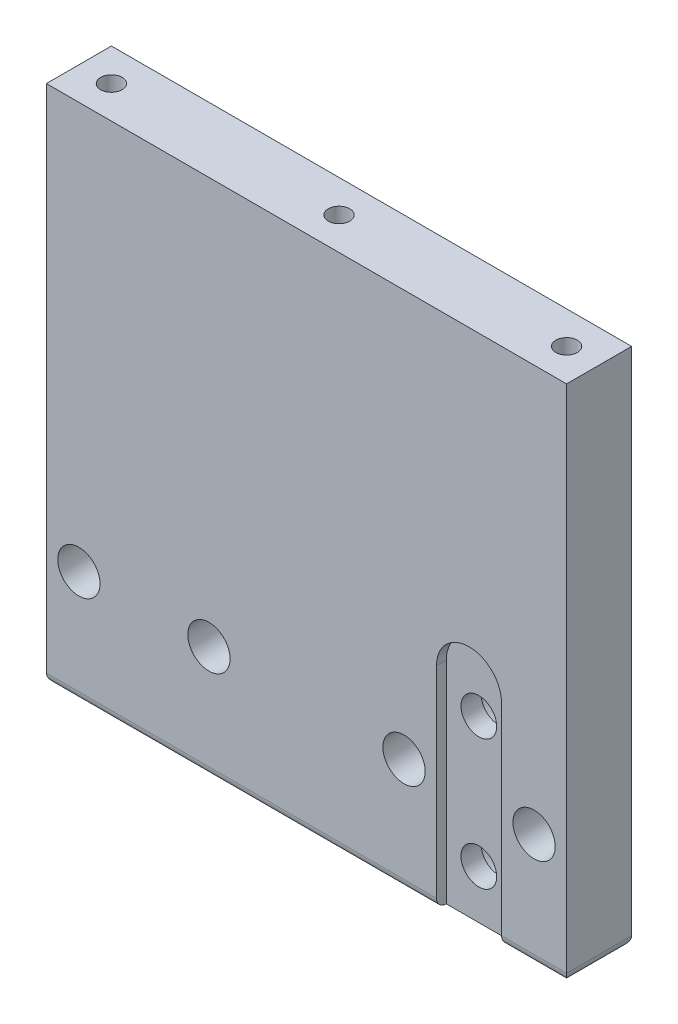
ISO-10303-21;
HEADER;
FILE_DESCRIPTION(('STEP AP214'),'2;1');
FILE_NAME('part.step','',(''),(''),'','','');
FILE_SCHEMA(('AUTOMOTIVE_DESIGN { 1 0 10303 214 1 1 1 1 }'));
ENDSEC;
DATA;
#1=APPLICATION_CONTEXT('core data for automotive mechanical design processes');
#2=APPLICATION_PROTOCOL_DEFINITION('international standard','automotive_design',2000,#1);
#3=PRODUCT_CONTEXT('',#1,'mechanical');
#4=PRODUCT('Part','Part','',(#3));
#5=PRODUCT_RELATED_PRODUCT_CATEGORY('part','',(#4));
#6=PRODUCT_DEFINITION_FORMATION('','',#4);
#7=PRODUCT_DEFINITION_CONTEXT('part definition',#1,'design');
#8=PRODUCT_DEFINITION('design','',#6,#7);
#9=PRODUCT_DEFINITION_SHAPE('','',#8);
#10=(LENGTH_UNIT() NAMED_UNIT(*) SI_UNIT(.MILLI.,.METRE.));
#11=(NAMED_UNIT(*) PLANE_ANGLE_UNIT() SI_UNIT($,.RADIAN.));
#12=(NAMED_UNIT(*) SI_UNIT($,.STERADIAN.) SOLID_ANGLE_UNIT());
#13=UNCERTAINTY_MEASURE_WITH_UNIT(LENGTH_MEASURE(1.E-05),#10,'distance_accuracy_value','');
#14=(GEOMETRIC_REPRESENTATION_CONTEXT(3) GLOBAL_UNCERTAINTY_ASSIGNED_CONTEXT((#13)) GLOBAL_UNIT_ASSIGNED_CONTEXT((#10,
#11,#12)) REPRESENTATION_CONTEXT('',''));
#15=CARTESIAN_POINT('',(0.,0.,0.));
#16=DIRECTION('',(0.,0.,1.));
#17=DIRECTION('',(1.,0.,0.));
#18=AXIS2_PLACEMENT_3D('',#15,#16,#17);
#19=CARTESIAN_POINT('',(25.,-10.,0.));
#20=DIRECTION('',(0.,0.,-1.));
#21=DIRECTION('',(-1.,0.,0.));
#22=AXIS2_PLACEMENT_3D('',#19,#20,#21);
#23=CYLINDRICAL_SURFACE('',#22,2.75);
#24=CARTESIAN_POINT('',(25.,-10.,8.5));
#25=DIRECTION('',(0.,0.,-1.));
#26=DIRECTION('',(-1.,0.,0.));
#27=AXIS2_PLACEMENT_3D('',#24,#25,#26);
#28=CIRCLE('',#27,2.75);
#29=CARTESIAN_POINT('',(22.25,-10.,8.5));
#30=VERTEX_POINT('',#29);
#31=EDGE_CURVE('E19',#30,#30,#28,.T.);
#32=ORIENTED_EDGE('',*,*,#31,.F.);
#33=EDGE_LOOP('',(#32));
#34=FACE_BOUND('',#33,.T.);
#35=CARTESIAN_POINT('',(25.,-10.,5.4));
#36=DIRECTION('',(0.,0.,-1.));
#37=DIRECTION('',(-1.,0.,0.));
#38=AXIS2_PLACEMENT_3D('',#35,#36,#37);
#39=CIRCLE('',#38,2.75);
#40=CARTESIAN_POINT('',(22.25,-10.,5.4));
#41=VERTEX_POINT('',#40);
#42=EDGE_CURVE('E140',#41,#41,#39,.T.);
#43=ORIENTED_EDGE('',*,*,#42,.T.);
#44=EDGE_LOOP('',(#43));
#45=FACE_BOUND('',#44,.T.);
#46=ADVANCED_FACE('F16',(#34,#45),#23,.F.);
#47=CARTESIAN_POINT('',(25.,10.,0.));
#48=DIRECTION('',(0.,0.,-1.));
#49=DIRECTION('',(-1.,0.,0.));
#50=AXIS2_PLACEMENT_3D('',#47,#48,#49);
#51=CYLINDRICAL_SURFACE('',#50,2.75);
#52=CARTESIAN_POINT('',(25.,10.,8.5));
#53=DIRECTION('',(0.,0.,-1.));
#54=DIRECTION('',(-1.,0.,0.));
#55=AXIS2_PLACEMENT_3D('',#52,#53,#54);
#56=CIRCLE('',#55,2.75);
#57=CARTESIAN_POINT('',(22.25,10.,8.5));
#58=VERTEX_POINT('',#57);
#59=EDGE_CURVE('E148',#58,#58,#56,.T.);
#60=ORIENTED_EDGE('',*,*,#59,.F.);
#61=EDGE_LOOP('',(#60));
#62=FACE_BOUND('',#61,.T.);
#63=CARTESIAN_POINT('',(25.,10.,5.4));
#64=DIRECTION('',(0.,0.,-1.));
#65=DIRECTION('',(-1.,0.,0.));
#66=AXIS2_PLACEMENT_3D('',#63,#64,#65);
#67=CIRCLE('',#66,2.75);
#68=CARTESIAN_POINT('',(22.25,10.,5.4));
#69=VERTEX_POINT('',#68);
#70=EDGE_CURVE('E165',#69,#69,#67,.T.);
#71=ORIENTED_EDGE('',*,*,#70,.T.);
#72=EDGE_LOOP('',(#71));
#73=FACE_BOUND('',#72,.T.);
#74=ADVANCED_FACE('F238',(#62,#73),#51,.F.);
#75=CARTESIAN_POINT('',(-35.,50.9999999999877,5.00000000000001));
#76=DIRECTION('',(0.,1.,0.));
#77=DIRECTION('',(0.,0.,1.));
#78=AXIS2_PLACEMENT_3D('',#75,#76,#77);
#79=CONICAL_SURFACE('',#78,1.64999999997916,1.04719755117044);
#80=CARTESIAN_POINT('',(-35.,50.0473720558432,5.0000000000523));
#81=VERTEX_POINT('',#80);
#82=VERTEX_LOOP('',#81);
#83=FACE_BOUND('',#82,.T.);
#84=CARTESIAN_POINT('',(-35.,51.,5.00000000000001));
#85=DIRECTION('',(0.,1.,0.));
#86=DIRECTION('',(0.,0.,1.));
#87=AXIS2_PLACEMENT_3D('',#84,#85,#86);
#88=CIRCLE('',#87,1.65);
#89=CARTESIAN_POINT('',(-35.,51.,6.65));
#90=VERTEX_POINT('',#89);
#91=EDGE_CURVE('E162',#90,#90,#88,.T.);
#92=ORIENTED_EDGE('',*,*,#91,.T.);
#93=EDGE_LOOP('',(#92));
#94=FACE_BOUND('',#93,.T.);
#95=ADVANCED_FACE('F338',(#83,#94),#79,.F.);
#96=CARTESIAN_POINT('',(35.,50.9999999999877,5.));
#97=DIRECTION('',(0.,1.,0.));
#98=DIRECTION('',(0.,0.,1.));
#99=AXIS2_PLACEMENT_3D('',#96,#97,#98);
#100=CONICAL_SURFACE('',#99,1.64999999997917,1.04719755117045);
#101=CARTESIAN_POINT('',(35.,50.0473720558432,5.0000000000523));
#102=VERTEX_POINT('',#101);
#103=VERTEX_LOOP('',#102);
#104=FACE_BOUND('',#103,.T.);
#105=CARTESIAN_POINT('',(35.,51.,5.));
#106=DIRECTION('',(0.,1.,0.));
#107=DIRECTION('',(0.,0.,1.));
#108=AXIS2_PLACEMENT_3D('',#105,#106,#107);
#109=CIRCLE('',#108,1.65);
#110=CARTESIAN_POINT('',(35.,51.,6.65));
#111=VERTEX_POINT('',#110);
#112=EDGE_CURVE('E159',#111,#111,#109,.T.);
#113=ORIENTED_EDGE('',*,*,#112,.T.);
#114=EDGE_LOOP('',(#113));
#115=FACE_BOUND('',#114,.T.);
#116=ADVANCED_FACE('F340',(#104,#115),#100,.F.);
#117=CARTESIAN_POINT('',(0.,50.9999999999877,5.));
#118=DIRECTION('',(0.,1.,0.));
#119=DIRECTION('',(0.,0.,1.));
#120=AXIS2_PLACEMENT_3D('',#117,#118,#119);
#121=CONICAL_SURFACE('',#120,1.65000000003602,1.04719755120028);
#122=CARTESIAN_POINT('',(0.,50.0473720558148,5.));
#123=VERTEX_POINT('',#122);
#124=VERTEX_LOOP('',#123);
#125=FACE_BOUND('',#124,.T.);
#126=CARTESIAN_POINT('',(0.,51.,5.));
#127=DIRECTION('',(0.,1.,0.));
#128=DIRECTION('',(0.,0.,1.));
#129=AXIS2_PLACEMENT_3D('',#126,#127,#128);
#130=CIRCLE('',#129,1.65);
#131=CARTESIAN_POINT('',(0.,51.,6.65));
#132=VERTEX_POINT('',#131);
#133=EDGE_CURVE('E156',#132,#132,#130,.T.);
#134=ORIENTED_EDGE('',*,*,#133,.T.);
#135=EDGE_LOOP('',(#134));
#136=FACE_BOUND('',#135,.T.);
#137=ADVANCED_FACE('F347',(#125,#136),#121,.F.);
#138=CARTESIAN_POINT('',(25.,15.,8.5));
#139=DIRECTION('',(0.,0.,1.));
#140=DIRECTION('',(1.,0.,0.));
#141=AXIS2_PLACEMENT_3D('',#138,#139,#140);
#142=PLANE('',#141);
#143=DIRECTION('',(0.,1.,0.));
#144=VECTOR('',#143,1.);
#145=CARTESIAN_POINT('',(30.,-17.5,8.5));
#146=LINE('',#145,#144);
#147=CARTESIAN_POINT('',(30.,-17.5,8.5));
#148=VERTEX_POINT('',#147);
#149=CARTESIAN_POINT('',(30.,15.,8.5));
#150=VERTEX_POINT('',#149);
#151=EDGE_CURVE('E103',#148,#150,#146,.T.);
#152=ORIENTED_EDGE('',*,*,#151,.T.);
#153=CARTESIAN_POINT('',(25.,15.,8.5));
#154=DIRECTION('',(0.,0.,1.));
#155=DIRECTION('',(1.,0.,0.));
#156=AXIS2_PLACEMENT_3D('',#153,#154,#155);
#157=CIRCLE('',#156,5.);
#158=CARTESIAN_POINT('',(20.,15.,8.5));
#159=VERTEX_POINT('',#158);
#160=EDGE_CURVE('E141',#150,#159,#157,.T.);
#161=ORIENTED_EDGE('',*,*,#160,.T.);
#162=DIRECTION('',(0.,1.,0.));
#163=VECTOR('',#162,1.);
#164=CARTESIAN_POINT('',(20.,-17.5,8.5));
#165=LINE('',#164,#163);
#166=CARTESIAN_POINT('',(20.,-17.5,8.5));
#167=VERTEX_POINT('',#166);
#168=EDGE_CURVE('E107',#159,#167,#165,.F.);
#169=ORIENTED_EDGE('',*,*,#168,.T.);
#170=DIRECTION('',(-1.,0.,0.));
#171=VECTOR('',#170,1.);
#172=CARTESIAN_POINT('',(-40.,-17.5,8.5));
#173=LINE('',#172,#171);
#174=EDGE_CURVE('E151',#167,#148,#173,.F.);
#175=ORIENTED_EDGE('',*,*,#174,.T.);
#176=EDGE_LOOP('',(#152,#161,#169,#175));
#177=FACE_BOUND('',#176,.T.);
#178=ORIENTED_EDGE('',*,*,#59,.T.);
#179=EDGE_LOOP('',(#178));
#180=FACE_BOUND('',#179,.T.);
#181=ORIENTED_EDGE('',*,*,#31,.T.);
#182=EDGE_LOOP('',(#181));
#183=FACE_BOUND('',#182,.T.);
#184=ADVANCED_FACE('F234',(#177,#180,#183),#142,.T.);
#185=CARTESIAN_POINT('',(30.,-17.5,8.5));
#186=DIRECTION('',(1.,0.,0.));
#187=DIRECTION('',(0.,0.,-1.));
#188=AXIS2_PLACEMENT_3D('',#185,#186,#187);
#189=PLANE('',#188);
#190=CARTESIAN_POINT('',(30.,-16.,8.5));
#191=DIRECTION('',(-1.,0.,0.));
#192=DIRECTION('',(0.,-1.,0.));
#193=AXIS2_PLACEMENT_3D('',#190,#191,#192);
#194=CIRCLE('',#193,1.5);
#195=CARTESIAN_POINT('',(30.,-16.,10.));
#196=VERTEX_POINT('',#195);
#197=EDGE_CURVE('E101',#196,#148,#194,.F.);
#198=ORIENTED_EDGE('',*,*,#197,.F.);
#199=DIRECTION('',(0.,1.,0.));
#200=VECTOR('',#199,1.);
#201=CARTESIAN_POINT('',(30.,-17.5,10.));
#202=LINE('',#201,#200);
#203=CARTESIAN_POINT('',(30.,15.,10.));
#204=VERTEX_POINT('',#203);
#205=EDGE_CURVE('E86',#204,#196,#202,.F.);
#206=ORIENTED_EDGE('',*,*,#205,.F.);
#207=DIRECTION('',(0.,0.,1.));
#208=VECTOR('',#207,1.);
#209=CARTESIAN_POINT('',(30.,15.,8.5));
#210=LINE('',#209,#208);
#211=EDGE_CURVE('E142',#204,#150,#210,.F.);
#212=ORIENTED_EDGE('',*,*,#211,.T.);
#213=ORIENTED_EDGE('',*,*,#151,.F.);
#214=EDGE_LOOP('',(#198,#206,#212,#213));
#215=FACE_BOUND('',#214,.T.);
#216=ADVANCED_FACE('F102',(#215),#189,.F.);
#217=CARTESIAN_POINT('',(-40.,-16.,8.5));
#218=DIRECTION('',(-1.,0.,0.));
#219=DIRECTION('',(0.,-1.,0.));
#220=AXIS2_PLACEMENT_3D('',#217,#218,#219);
#221=CYLINDRICAL_SURFACE('',#220,1.5);
#222=CARTESIAN_POINT('',(38.5,-16.,8.5));
#223=DIRECTION('',(0.707106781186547,0.,-0.707106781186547));
#224=DIRECTION('',(-0.707106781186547,0.,-0.707106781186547));
#225=AXIS2_PLACEMENT_3D('',#222,#223,#224);
#226=ELLIPSE('',#225,2.12132034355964,1.5);
#227=CARTESIAN_POINT('',(40.,-16.,10.));
#228=VERTEX_POINT('',#227);
#229=CARTESIAN_POINT('',(38.5,-17.5,8.5));
#230=VERTEX_POINT('',#229);
#231=EDGE_CURVE('E110',#228,#230,#226,.T.);
#232=ORIENTED_EDGE('',*,*,#231,.F.);
#233=DIRECTION('',(1.,0.,0.));
#234=VECTOR('',#233,1.);
#235=CARTESIAN_POINT('',(-40.,-16.,10.));
#236=LINE('',#235,#234);
#237=EDGE_CURVE('E91',#196,#228,#236,.T.);
#238=ORIENTED_EDGE('',*,*,#237,.F.);
#239=ORIENTED_EDGE('',*,*,#197,.T.);
#240=DIRECTION('',(-1.,0.,0.));
#241=VECTOR('',#240,1.);
#242=CARTESIAN_POINT('',(-40.,-17.5,8.5));
#243=LINE('',#242,#241);
#244=EDGE_CURVE('E149',#148,#230,#243,.F.);
#245=ORIENTED_EDGE('',*,*,#244,.T.);
#246=EDGE_LOOP('',(#232,#238,#239,#245));
#247=FACE_BOUND('',#246,.T.);
#248=ADVANCED_FACE('F109',(#247),#221,.T.);
#249=CARTESIAN_POINT('',(-40.,-16.,8.5));
#250=DIRECTION('',(-1.,0.,0.));
#251=DIRECTION('',(0.,-1.,0.));
#252=AXIS2_PLACEMENT_3D('',#249,#250,#251);
#253=CYLINDRICAL_SURFACE('',#252,1.5);
#254=CARTESIAN_POINT('',(-38.5,-16.,8.5));
#255=DIRECTION('',(-0.707106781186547,0.,-0.707106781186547));
#256=DIRECTION('',(0.707106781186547,0.,-0.707106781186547));
#257=AXIS2_PLACEMENT_3D('',#254,#255,#256);
#258=ELLIPSE('',#257,2.12132034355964,1.5);
#259=CARTESIAN_POINT('',(-38.5,-17.5,8.5));
#260=VERTEX_POINT('',#259);
#261=CARTESIAN_POINT('',(-40.,-16.,10.));
#262=VERTEX_POINT('',#261);
#263=EDGE_CURVE('E130',#260,#262,#258,.T.);
#264=ORIENTED_EDGE('',*,*,#263,.F.);
#265=DIRECTION('',(-1.,0.,0.));
#266=VECTOR('',#265,1.);
#267=CARTESIAN_POINT('',(-40.,-17.5,8.5));
#268=LINE('',#267,#266);
#269=EDGE_CURVE('E129',#260,#167,#268,.F.);
#270=ORIENTED_EDGE('',*,*,#269,.T.);
#271=CARTESIAN_POINT('',(20.,-16.,8.5));
#272=DIRECTION('',(-1.,0.,0.));
#273=DIRECTION('',(0.,-1.,0.));
#274=AXIS2_PLACEMENT_3D('',#271,#272,#273);
#275=CIRCLE('',#274,1.5);
#276=CARTESIAN_POINT('',(20.,-16.,10.));
#277=VERTEX_POINT('',#276);
#278=EDGE_CURVE('E144',#167,#277,#275,.T.);
#279=ORIENTED_EDGE('',*,*,#278,.T.);
#280=DIRECTION('',(1.,0.,0.));
#281=VECTOR('',#280,1.);
#282=CARTESIAN_POINT('',(-40.,-16.,10.));
#283=LINE('',#282,#281);
#284=EDGE_CURVE('E111',#262,#277,#283,.T.);
#285=ORIENTED_EDGE('',*,*,#284,.F.);
#286=EDGE_LOOP('',(#264,#270,#279,#285));
#287=FACE_BOUND('',#286,.T.);
#288=ADVANCED_FACE('F363',(#287),#253,.T.);
#289=CARTESIAN_POINT('',(20.,-17.5,8.5));
#290=DIRECTION('',(-1.,0.,0.));
#291=DIRECTION('',(0.,0.,1.));
#292=AXIS2_PLACEMENT_3D('',#289,#290,#291);
#293=PLANE('',#292);
#294=ORIENTED_EDGE('',*,*,#278,.F.);
#295=ORIENTED_EDGE('',*,*,#168,.F.);
#296=DIRECTION('',(0.,0.,1.));
#297=VECTOR('',#296,1.);
#298=CARTESIAN_POINT('',(20.,15.,8.5));
#299=LINE('',#298,#297);
#300=CARTESIAN_POINT('',(20.,15.,10.));
#301=VERTEX_POINT('',#300);
#302=EDGE_CURVE('E137',#159,#301,#299,.T.);
#303=ORIENTED_EDGE('',*,*,#302,.T.);
#304=DIRECTION('',(0.,1.,0.));
#305=VECTOR('',#304,1.);
#306=CARTESIAN_POINT('',(20.,-17.5,10.));
#307=LINE('',#306,#305);
#308=EDGE_CURVE('E113',#277,#301,#307,.T.);
#309=ORIENTED_EDGE('',*,*,#308,.F.);
#310=EDGE_LOOP('',(#294,#295,#303,#309));
#311=FACE_BOUND('',#310,.T.);
#312=ADVANCED_FACE('F255',(#311),#293,.F.);
#313=CARTESIAN_POINT('',(25.,15.,8.5));
#314=DIRECTION('',(0.,0.,1.));
#315=DIRECTION('',(1.,0.,0.));
#316=AXIS2_PLACEMENT_3D('',#313,#314,#315);
#317=CYLINDRICAL_SURFACE('',#316,5.);
#318=ORIENTED_EDGE('',*,*,#302,.F.);
#319=ORIENTED_EDGE('',*,*,#160,.F.);
#320=ORIENTED_EDGE('',*,*,#211,.F.);
#321=CARTESIAN_POINT('',(25.,15.,10.));
#322=DIRECTION('',(0.,0.,1.));
#323=DIRECTION('',(1.,0.,0.));
#324=AXIS2_PLACEMENT_3D('',#321,#322,#323);
#325=CIRCLE('',#324,5.);
#326=EDGE_CURVE('E94',#301,#204,#325,.F.);
#327=ORIENTED_EDGE('',*,*,#326,.F.);
#328=EDGE_LOOP('',(#318,#319,#320,#327));
#329=FACE_BOUND('',#328,.T.);
#330=ADVANCED_FACE('F244',(#329),#317,.F.);
#331=CARTESIAN_POINT('',(27.75,-10.,5.4));
#332=DIRECTION('',(0.,0.,1.));
#333=DIRECTION('',(1.,0.,0.));
#334=AXIS2_PLACEMENT_3D('',#331,#332,#333);
#335=PLANE('',#334);
#336=CARTESIAN_POINT('',(25.,-10.,5.4));
#337=DIRECTION('',(0.,0.,-1.));
#338=DIRECTION('',(-1.,0.,0.));
#339=AXIS2_PLACEMENT_3D('',#336,#337,#338);
#340=CIRCLE('',#339,5.);
#341=CARTESIAN_POINT('',(20.,-10.,5.4));
#342=VERTEX_POINT('',#341);
#343=EDGE_CURVE('E215',#342,#342,#340,.T.);
#344=ORIENTED_EDGE('',*,*,#343,.T.);
#345=EDGE_LOOP('',(#344));
#346=FACE_BOUND('',#345,.T.);
#347=ORIENTED_EDGE('',*,*,#42,.F.);
#348=EDGE_LOOP('',(#347));
#349=FACE_BOUND('',#348,.T.);
#350=ADVANCED_FACE('F241',(#346,#349),#335,.F.);
#351=CARTESIAN_POINT('',(27.75,10.,5.4));
#352=DIRECTION('',(0.,0.,1.));
#353=DIRECTION('',(1.,0.,0.));
#354=AXIS2_PLACEMENT_3D('',#351,#352,#353);
#355=PLANE('',#354);
#356=CARTESIAN_POINT('',(25.,10.,5.4));
#357=DIRECTION('',(0.,0.,-1.));
#358=DIRECTION('',(-1.,0.,0.));
#359=AXIS2_PLACEMENT_3D('',#356,#357,#358);
#360=CIRCLE('',#359,5.);
#361=CARTESIAN_POINT('',(20.,10.,5.4));
#362=VERTEX_POINT('',#361);
#363=EDGE_CURVE('E212',#362,#362,#360,.T.);
#364=ORIENTED_EDGE('',*,*,#363,.T.);
#365=EDGE_LOOP('',(#364));
#366=FACE_BOUND('',#365,.T.);
#367=ORIENTED_EDGE('',*,*,#70,.F.);
#368=EDGE_LOOP('',(#367));
#369=FACE_BOUND('',#368,.T.);
#370=ADVANCED_FACE('F243',(#366,#369),#355,.F.);
#371=CARTESIAN_POINT('',(-35.,62.5,5.00000000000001));
#372=DIRECTION('',(0.,1.,0.));
#373=DIRECTION('',(0.,0.,1.));
#374=AXIS2_PLACEMENT_3D('',#371,#372,#373);
#375=CYLINDRICAL_SURFACE('',#374,1.65);
#376=ORIENTED_EDGE('',*,*,#91,.F.);
#377=EDGE_LOOP('',(#376));
#378=FACE_BOUND('',#377,.T.);
#379=CARTESIAN_POINT('',(-35.,62.5,5.00000000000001));
#380=DIRECTION('',(0.,1.,0.));
#381=DIRECTION('',(0.,0.,1.));
#382=AXIS2_PLACEMENT_3D('',#379,#380,#381);
#383=CIRCLE('',#382,1.65);
#384=CARTESIAN_POINT('',(-35.,62.5,6.65));
#385=VERTEX_POINT('',#384);
#386=EDGE_CURVE('E197',#385,#385,#383,.T.);
#387=ORIENTED_EDGE('',*,*,#386,.T.);
#388=EDGE_LOOP('',(#387));
#389=FACE_BOUND('',#388,.T.);
#390=ADVANCED_FACE('F252',(#378,#389),#375,.F.);
#391=CARTESIAN_POINT('',(35.,62.5,5.));
#392=DIRECTION('',(0.,1.,0.));
#393=DIRECTION('',(0.,0.,1.));
#394=AXIS2_PLACEMENT_3D('',#391,#392,#393);
#395=CYLINDRICAL_SURFACE('',#394,1.65);
#396=ORIENTED_EDGE('',*,*,#112,.F.);
#397=EDGE_LOOP('',(#396));
#398=FACE_BOUND('',#397,.T.);
#399=CARTESIAN_POINT('',(35.,62.5,5.));
#400=DIRECTION('',(0.,1.,0.));
#401=DIRECTION('',(0.,0.,1.));
#402=AXIS2_PLACEMENT_3D('',#399,#400,#401);
#403=CIRCLE('',#402,1.65);
#404=CARTESIAN_POINT('',(35.,62.5,6.65));
#405=VERTEX_POINT('',#404);
#406=EDGE_CURVE('E194',#405,#405,#403,.T.);
#407=ORIENTED_EDGE('',*,*,#406,.T.);
#408=EDGE_LOOP('',(#407));
#409=FACE_BOUND('',#408,.T.);
#410=ADVANCED_FACE('F324',(#398,#409),#395,.F.);
#411=CARTESIAN_POINT('',(0.,62.5,5.));
#412=DIRECTION('',(0.,1.,0.));
#413=DIRECTION('',(0.,0.,1.));
#414=AXIS2_PLACEMENT_3D('',#411,#412,#413);
#415=CYLINDRICAL_SURFACE('',#414,1.65);
#416=ORIENTED_EDGE('',*,*,#133,.F.);
#417=EDGE_LOOP('',(#416));
#418=FACE_BOUND('',#417,.T.);
#419=CARTESIAN_POINT('',(0.,62.5,5.));
#420=DIRECTION('',(0.,1.,0.));
#421=DIRECTION('',(0.,0.,1.));
#422=AXIS2_PLACEMENT_3D('',#419,#420,#421);
#423=CIRCLE('',#422,1.65);
#424=CARTESIAN_POINT('',(0.,62.5,6.65));
#425=VERTEX_POINT('',#424);
#426=EDGE_CURVE('E123',#425,#425,#423,.T.);
#427=ORIENTED_EDGE('',*,*,#426,.T.);
#428=EDGE_LOOP('',(#427));
#429=FACE_BOUND('',#428,.T.);
#430=ADVANCED_FACE('F320',(#418,#429),#415,.F.);
#431=CARTESIAN_POINT('',(-38.5,-16.,10.));
#432=DIRECTION('',(0.,0.,-1.));
#433=DIRECTION('',(-1.,0.,0.));
#434=AXIS2_PLACEMENT_3D('',#431,#432,#433);
#435=CYLINDRICAL_SURFACE('',#434,1.5);
#436=CARTESIAN_POINT('',(-38.5,-16.,1.5));
#437=DIRECTION('',(0.707106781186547,0.,-0.707106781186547));
#438=DIRECTION('',(0.707106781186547,0.,0.707106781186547));
#439=AXIS2_PLACEMENT_3D('',#436,#437,#438);
#440=ELLIPSE('',#439,2.12132034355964,1.5);
#441=CARTESIAN_POINT('',(-38.5,-17.5,1.5));
#442=VERTEX_POINT('',#441);
#443=CARTESIAN_POINT('',(-40.,-16.,0.));
#444=VERTEX_POINT('',#443);
#445=EDGE_CURVE('E190',#442,#444,#440,.T.);
#446=ORIENTED_EDGE('',*,*,#445,.F.);
#447=DIRECTION('',(0.,0.,1.));
#448=VECTOR('',#447,1.);
#449=CARTESIAN_POINT('',(-38.5,-17.5,10.));
#450=LINE('',#449,#448);
#451=EDGE_CURVE('E126',#442,#260,#450,.T.);
#452=ORIENTED_EDGE('',*,*,#451,.T.);
#453=ORIENTED_EDGE('',*,*,#263,.T.);
#454=DIRECTION('',(0.,0.,1.));
#455=VECTOR('',#454,1.);
#456=CARTESIAN_POINT('',(-40.,-16.,10.));
#457=LINE('',#456,#455);
#458=EDGE_CURVE('E134',#262,#444,#457,.F.);
#459=ORIENTED_EDGE('',*,*,#458,.T.);
#460=EDGE_LOOP('',(#446,#452,#453,#459));
#461=FACE_BOUND('',#460,.T.);
#462=ADVANCED_FACE('F316',(#461),#435,.T.);
#463=CARTESIAN_POINT('',(-40.,-17.5,10.));
#464=DIRECTION('',(0.,1.,0.));
#465=DIRECTION('',(-1.,0.,0.));
#466=AXIS2_PLACEMENT_3D('',#463,#464,#465);
#467=PLANE('',#466);
#468=ORIENTED_EDGE('',*,*,#244,.F.);
#469=ORIENTED_EDGE('',*,*,#174,.F.);
#470=ORIENTED_EDGE('',*,*,#269,.F.);
#471=ORIENTED_EDGE('',*,*,#451,.F.);
#472=DIRECTION('',(1.,0.,0.));
#473=VECTOR('',#472,1.);
#474=CARTESIAN_POINT('',(-40.,-17.5,1.5));
#475=LINE('',#474,#473);
#476=CARTESIAN_POINT('',(38.5,-17.5,1.5));
#477=VERTEX_POINT('',#476);
#478=EDGE_CURVE('E189',#477,#442,#475,.F.);
#479=ORIENTED_EDGE('',*,*,#478,.F.);
#480=DIRECTION('',(0.,0.,-1.));
#481=VECTOR('',#480,1.);
#482=CARTESIAN_POINT('',(38.5,-17.5,10.));
#483=LINE('',#482,#481);
#484=EDGE_CURVE('E97',#230,#477,#483,.T.);
#485=ORIENTED_EDGE('',*,*,#484,.F.);
#486=EDGE_LOOP('',(#468,#469,#470,#471,#479,#485));
#487=FACE_BOUND('',#486,.T.);
#488=ADVANCED_FACE('F312',(#487),#467,.F.);
#489=CARTESIAN_POINT('',(38.5,-16.,10.));
#490=DIRECTION('',(0.,0.,-1.));
#491=DIRECTION('',(-1.,0.,0.));
#492=AXIS2_PLACEMENT_3D('',#489,#490,#491);
#493=CYLINDRICAL_SURFACE('',#492,1.5);
#494=ORIENTED_EDGE('',*,*,#231,.T.);
#495=ORIENTED_EDGE('',*,*,#484,.T.);
#496=CARTESIAN_POINT('',(38.5,-16.,1.5));
#497=DIRECTION('',(0.707106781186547,0.,0.707106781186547));
#498=DIRECTION('',(0.707106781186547,0.,-0.707106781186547));
#499=AXIS2_PLACEMENT_3D('',#496,#497,#498);
#500=ELLIPSE('',#499,2.12132034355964,1.5);
#501=CARTESIAN_POINT('',(40.,-16.,0.));
#502=VERTEX_POINT('',#501);
#503=EDGE_CURVE('E186',#502,#477,#500,.F.);
#504=ORIENTED_EDGE('',*,*,#503,.F.);
#505=DIRECTION('',(0.,0.,1.));
#506=VECTOR('',#505,1.);
#507=CARTESIAN_POINT('',(40.,-16.,10.));
#508=LINE('',#507,#506);
#509=EDGE_CURVE('E33',#502,#228,#508,.T.);
#510=ORIENTED_EDGE('',*,*,#509,.T.);
#511=EDGE_LOOP('',(#494,#495,#504,#510));
#512=FACE_BOUND('',#511,.T.);
#513=ADVANCED_FACE('F308',(#512),#493,.T.);
#514=CARTESIAN_POINT('',(-40.,-17.5,10.));
#515=DIRECTION('',(0.,0.,1.));
#516=DIRECTION('',(1.,0.,0.));
#517=AXIS2_PLACEMENT_3D('',#514,#515,#516);
#518=PLANE('',#517);
#519=CARTESIAN_POINT('',(-35.,0.,10.));
#520=DIRECTION('',(0.,0.,1.));
#521=DIRECTION('',(1.,0.,0.));
#522=AXIS2_PLACEMENT_3D('',#519,#520,#521);
#523=CIRCLE('',#522,3.25);
#524=CARTESIAN_POINT('',(-31.75,0.,10.));
#525=VERTEX_POINT('',#524);
#526=EDGE_CURVE('E200',#525,#525,#523,.F.);
#527=ORIENTED_EDGE('',*,*,#526,.T.);
#528=EDGE_LOOP('',(#527));
#529=FACE_BOUND('',#528,.T.);
#530=CARTESIAN_POINT('',(-15.,0.,10.));
#531=DIRECTION('',(0.,0.,1.));
#532=DIRECTION('',(1.,0.,0.));
#533=AXIS2_PLACEMENT_3D('',#530,#531,#532);
#534=CIRCLE('',#533,3.25);
#535=CARTESIAN_POINT('',(-11.75,0.,10.));
#536=VERTEX_POINT('',#535);
#537=EDGE_CURVE('E203',#536,#536,#534,.F.);
#538=ORIENTED_EDGE('',*,*,#537,.T.);
#539=EDGE_LOOP('',(#538));
#540=FACE_BOUND('',#539,.T.);
#541=CARTESIAN_POINT('',(15.,0.,10.));
#542=DIRECTION('',(0.,0.,1.));
#543=DIRECTION('',(1.,0.,0.));
#544=AXIS2_PLACEMENT_3D('',#541,#542,#543);
#545=CIRCLE('',#544,3.25);
#546=CARTESIAN_POINT('',(18.25,0.,10.));
#547=VERTEX_POINT('',#546);
#548=EDGE_CURVE('E206',#547,#547,#545,.F.);
#549=ORIENTED_EDGE('',*,*,#548,.T.);
#550=EDGE_LOOP('',(#549));
#551=FACE_BOUND('',#550,.T.);
#552=CARTESIAN_POINT('',(35.,0.,10.));
#553=DIRECTION('',(0.,0.,1.));
#554=DIRECTION('',(1.,0.,0.));
#555=AXIS2_PLACEMENT_3D('',#552,#553,#554);
#556=CIRCLE('',#555,3.25);
#557=CARTESIAN_POINT('',(38.25,0.,10.));
#558=VERTEX_POINT('',#557);
#559=EDGE_CURVE('E209',#558,#558,#556,.F.);
#560=ORIENTED_EDGE('',*,*,#559,.T.);
#561=EDGE_LOOP('',(#560));
#562=FACE_BOUND('',#561,.T.);
#563=ORIENTED_EDGE('',*,*,#308,.T.);
#564=ORIENTED_EDGE('',*,*,#326,.T.);
#565=ORIENTED_EDGE('',*,*,#205,.T.);
#566=ORIENTED_EDGE('',*,*,#237,.T.);
#567=DIRECTION('',(0.,-1.,0.));
#568=VECTOR('',#567,1.);
#569=CARTESIAN_POINT('',(40.,62.5,10.));
#570=LINE('',#569,#568);
#571=CARTESIAN_POINT('',(40.,62.5,10.));
#572=VERTEX_POINT('',#571);
#573=EDGE_CURVE('E185',#228,#572,#570,.F.);
#574=ORIENTED_EDGE('',*,*,#573,.T.);
#575=DIRECTION('',(1.,0.,0.));
#576=VECTOR('',#575,1.);
#577=CARTESIAN_POINT('',(-40.,62.5,10.));
#578=LINE('',#577,#576);
#579=CARTESIAN_POINT('',(-40.,62.5,10.));
#580=VERTEX_POINT('',#579);
#581=EDGE_CURVE('E119',#572,#580,#578,.F.);
#582=ORIENTED_EDGE('',*,*,#581,.T.);
#583=DIRECTION('',(0.,1.,0.));
#584=VECTOR('',#583,1.);
#585=CARTESIAN_POINT('',(-40.,62.5,10.));
#586=LINE('',#585,#584);
#587=EDGE_CURVE('E131',#580,#262,#586,.F.);
#588=ORIENTED_EDGE('',*,*,#587,.T.);
#589=ORIENTED_EDGE('',*,*,#284,.T.);
#590=EDGE_LOOP('',(#563,#564,#565,#566,#574,#582,#588,#589));
#591=FACE_BOUND('',#590,.T.);
#592=ADVANCED_FACE('F88',(#529,#540,#551,#562,#591),#518,.T.);
#593=CARTESIAN_POINT('',(25.,-10.,0.));
#594=DIRECTION('',(0.,0.,-1.));
#595=DIRECTION('',(-1.,0.,0.));
#596=AXIS2_PLACEMENT_3D('',#593,#594,#595);
#597=CYLINDRICAL_SURFACE('',#596,5.);
#598=ORIENTED_EDGE('',*,*,#343,.F.);
#599=EDGE_LOOP('',(#598));
#600=FACE_BOUND('',#599,.T.);
#601=CARTESIAN_POINT('',(25.,-10.,0.));
#602=DIRECTION('',(0.,0.,-1.));
#603=DIRECTION('',(-1.,0.,0.));
#604=AXIS2_PLACEMENT_3D('',#601,#602,#603);
#605=CIRCLE('',#604,5.);
#606=CARTESIAN_POINT('',(20.,-10.,0.));
#607=VERTEX_POINT('',#606);
#608=EDGE_CURVE('E182',#607,#607,#605,.T.);
#609=ORIENTED_EDGE('',*,*,#608,.T.);
#610=EDGE_LOOP('',(#609));
#611=FACE_BOUND('',#610,.T.);
#612=ADVANCED_FACE('F301',(#600,#611),#597,.F.);
#613=CARTESIAN_POINT('',(25.,10.,0.));
#614=DIRECTION('',(0.,0.,-1.));
#615=DIRECTION('',(-1.,0.,0.));
#616=AXIS2_PLACEMENT_3D('',#613,#614,#615);
#617=CYLINDRICAL_SURFACE('',#616,5.);
#618=ORIENTED_EDGE('',*,*,#363,.F.);
#619=EDGE_LOOP('',(#618));
#620=FACE_BOUND('',#619,.T.);
#621=CARTESIAN_POINT('',(25.,10.,0.));
#622=DIRECTION('',(0.,0.,-1.));
#623=DIRECTION('',(-1.,0.,0.));
#624=AXIS2_PLACEMENT_3D('',#621,#622,#623);
#625=CIRCLE('',#624,5.);
#626=CARTESIAN_POINT('',(20.,10.,0.));
#627=VERTEX_POINT('',#626);
#628=EDGE_CURVE('E179',#627,#627,#625,.T.);
#629=ORIENTED_EDGE('',*,*,#628,.T.);
#630=EDGE_LOOP('',(#629));
#631=FACE_BOUND('',#630,.T.);
#632=ADVANCED_FACE('F297',(#620,#631),#617,.F.);
#633=CARTESIAN_POINT('',(35.,0.,-25.));
#634=DIRECTION('',(0.,0.,1.));
#635=DIRECTION('',(1.,0.,0.));
#636=AXIS2_PLACEMENT_3D('',#633,#634,#635);
#637=CYLINDRICAL_SURFACE('',#636,3.25);
#638=CARTESIAN_POINT('',(35.,0.,0.));
#639=DIRECTION('',(0.,0.,1.));
#640=DIRECTION('',(1.,0.,0.));
#641=AXIS2_PLACEMENT_3D('',#638,#639,#640);
#642=CIRCLE('',#641,3.25);
#643=CARTESIAN_POINT('',(38.25,0.,0.));
#644=VERTEX_POINT('',#643);
#645=EDGE_CURVE('E176',#644,#644,#642,.F.);
#646=ORIENTED_EDGE('',*,*,#645,.T.);
#647=EDGE_LOOP('',(#646));
#648=FACE_BOUND('',#647,.T.);
#649=ORIENTED_EDGE('',*,*,#559,.F.);
#650=EDGE_LOOP('',(#649));
#651=FACE_BOUND('',#650,.T.);
#652=ADVANCED_FACE('F293',(#648,#651),#637,.F.);
#653=CARTESIAN_POINT('',(15.,0.,-25.));
#654=DIRECTION('',(0.,0.,1.));
#655=DIRECTION('',(1.,0.,0.));
#656=AXIS2_PLACEMENT_3D('',#653,#654,#655);
#657=CYLINDRICAL_SURFACE('',#656,3.25);
#658=CARTESIAN_POINT('',(15.,0.,0.));
#659=DIRECTION('',(0.,0.,1.));
#660=DIRECTION('',(1.,0.,0.));
#661=AXIS2_PLACEMENT_3D('',#658,#659,#660);
#662=CIRCLE('',#661,3.25);
#663=CARTESIAN_POINT('',(18.25,0.,0.));
#664=VERTEX_POINT('',#663);
#665=EDGE_CURVE('E173',#664,#664,#662,.F.);
#666=ORIENTED_EDGE('',*,*,#665,.T.);
#667=EDGE_LOOP('',(#666));
#668=FACE_BOUND('',#667,.T.);
#669=ORIENTED_EDGE('',*,*,#548,.F.);
#670=EDGE_LOOP('',(#669));
#671=FACE_BOUND('',#670,.T.);
#672=ADVANCED_FACE('F289',(#668,#671),#657,.F.);
#673=CARTESIAN_POINT('',(-15.,0.,-25.));
#674=DIRECTION('',(0.,0.,1.));
#675=DIRECTION('',(1.,0.,0.));
#676=AXIS2_PLACEMENT_3D('',#673,#674,#675);
#677=CYLINDRICAL_SURFACE('',#676,3.25);
#678=CARTESIAN_POINT('',(-15.,0.,0.));
#679=DIRECTION('',(0.,0.,1.));
#680=DIRECTION('',(1.,0.,0.));
#681=AXIS2_PLACEMENT_3D('',#678,#679,#680);
#682=CIRCLE('',#681,3.25);
#683=CARTESIAN_POINT('',(-11.75,0.,0.));
#684=VERTEX_POINT('',#683);
#685=EDGE_CURVE('E170',#684,#684,#682,.F.);
#686=ORIENTED_EDGE('',*,*,#685,.T.);
#687=EDGE_LOOP('',(#686));
#688=FACE_BOUND('',#687,.T.);
#689=ORIENTED_EDGE('',*,*,#537,.F.);
#690=EDGE_LOOP('',(#689));
#691=FACE_BOUND('',#690,.T.);
#692=ADVANCED_FACE('F285',(#688,#691),#677,.F.);
#693=CARTESIAN_POINT('',(-35.,0.,-25.));
#694=DIRECTION('',(0.,0.,1.));
#695=DIRECTION('',(1.,0.,0.));
#696=AXIS2_PLACEMENT_3D('',#693,#694,#695);
#697=CYLINDRICAL_SURFACE('',#696,3.25);
#698=CARTESIAN_POINT('',(-35.,0.,0.));
#699=DIRECTION('',(0.,0.,1.));
#700=DIRECTION('',(1.,0.,0.));
#701=AXIS2_PLACEMENT_3D('',#698,#699,#700);
#702=CIRCLE('',#701,3.25);
#703=CARTESIAN_POINT('',(-31.75,0.,0.));
#704=VERTEX_POINT('',#703);
#705=EDGE_CURVE('E166',#704,#704,#702,.F.);
#706=ORIENTED_EDGE('',*,*,#705,.T.);
#707=EDGE_LOOP('',(#706));
#708=FACE_BOUND('',#707,.T.);
#709=ORIENTED_EDGE('',*,*,#526,.F.);
#710=EDGE_LOOP('',(#709));
#711=FACE_BOUND('',#710,.T.);
#712=ADVANCED_FACE('F281',(#708,#711),#697,.F.);
#713=CARTESIAN_POINT('',(-40.,62.5,10.));
#714=DIRECTION('',(0.,-1.,0.));
#715=DIRECTION('',(1.,0.,0.));
#716=AXIS2_PLACEMENT_3D('',#713,#714,#715);
#717=PLANE('',#716);
#718=DIRECTION('',(0.,0.,1.));
#719=VECTOR('',#718,1.);
#720=CARTESIAN_POINT('',(-40.,62.5,10.));
#721=LINE('',#720,#719);
#722=CARTESIAN_POINT('',(-40.,62.5,0.));
#723=VERTEX_POINT('',#722);
#724=EDGE_CURVE('E122',#723,#580,#721,.T.);
#725=ORIENTED_EDGE('',*,*,#724,.T.);
#726=ORIENTED_EDGE('',*,*,#581,.F.);
#727=DIRECTION('',(0.,0.,1.));
#728=VECTOR('',#727,1.);
#729=CARTESIAN_POINT('',(40.,62.5,10.));
#730=LINE('',#729,#728);
#731=CARTESIAN_POINT('',(40.,62.5,0.));
#732=VERTEX_POINT('',#731);
#733=EDGE_CURVE('E382',#572,#732,#730,.F.);
#734=ORIENTED_EDGE('',*,*,#733,.T.);
#735=DIRECTION('',(1.,0.,0.));
#736=VECTOR('',#735,1.);
#737=CARTESIAN_POINT('',(-40.,62.5,0.));
#738=LINE('',#737,#736);
#739=EDGE_CURVE('E169',#732,#723,#738,.F.);
#740=ORIENTED_EDGE('',*,*,#739,.T.);
#741=EDGE_LOOP('',(#725,#726,#734,#740));
#742=FACE_BOUND('',#741,.T.);
#743=ORIENTED_EDGE('',*,*,#426,.F.);
#744=EDGE_LOOP('',(#743));
#745=FACE_BOUND('',#744,.T.);
#746=ORIENTED_EDGE('',*,*,#406,.F.);
#747=EDGE_LOOP('',(#746));
#748=FACE_BOUND('',#747,.T.);
#749=ORIENTED_EDGE('',*,*,#386,.F.);
#750=EDGE_LOOP('',(#749));
#751=FACE_BOUND('',#750,.T.);
#752=ADVANCED_FACE('F277',(#742,#745,#748,#751),#717,.F.);
#753=CARTESIAN_POINT('',(-40.,62.5,10.));
#754=DIRECTION('',(1.,0.,0.));
#755=DIRECTION('',(0.,1.,0.));
#756=AXIS2_PLACEMENT_3D('',#753,#754,#755);
#757=PLANE('',#756);
#758=ORIENTED_EDGE('',*,*,#458,.F.);
#759=ORIENTED_EDGE('',*,*,#587,.F.);
#760=ORIENTED_EDGE('',*,*,#724,.F.);
#761=DIRECTION('',(0.,1.,0.));
#762=VECTOR('',#761,1.);
#763=CARTESIAN_POINT('',(-40.,-17.5,0.));
#764=LINE('',#763,#762);
#765=EDGE_CURVE('E397',#723,#444,#764,.F.);
#766=ORIENTED_EDGE('',*,*,#765,.T.);
#767=EDGE_LOOP('',(#758,#759,#760,#766));
#768=FACE_BOUND('',#767,.T.);
#769=ADVANCED_FACE('F273',(#768),#757,.F.);
#770=CARTESIAN_POINT('',(-40.,-16.,1.5));
#771=DIRECTION('',(1.,0.,0.));
#772=DIRECTION('',(0.,1.,0.));
#773=AXIS2_PLACEMENT_3D('',#770,#771,#772);
#774=CYLINDRICAL_SURFACE('',#773,1.5);
#775=ORIENTED_EDGE('',*,*,#503,.T.);
#776=ORIENTED_EDGE('',*,*,#478,.T.);
#777=ORIENTED_EDGE('',*,*,#445,.T.);
#778=DIRECTION('',(1.,0.,0.));
#779=VECTOR('',#778,1.);
#780=CARTESIAN_POINT('',(-40.,-16.,0.));
#781=LINE('',#780,#779);
#782=EDGE_CURVE('E25',#444,#502,#781,.T.);
#783=ORIENTED_EDGE('',*,*,#782,.T.);
#784=EDGE_LOOP('',(#775,#776,#777,#783));
#785=FACE_BOUND('',#784,.T.);
#786=ADVANCED_FACE('F266',(#785),#774,.T.);
#787=CARTESIAN_POINT('',(40.,62.5,10.));
#788=DIRECTION('',(-1.,0.,0.));
#789=DIRECTION('',(0.,-1.,0.));
#790=AXIS2_PLACEMENT_3D('',#787,#788,#789);
#791=PLANE('',#790);
#792=ORIENTED_EDGE('',*,*,#509,.F.);
#793=DIRECTION('',(0.,1.,0.));
#794=VECTOR('',#793,1.);
#795=CARTESIAN_POINT('',(40.,-17.5,0.));
#796=LINE('',#795,#794);
#797=EDGE_CURVE('E11',#502,#732,#796,.T.);
#798=ORIENTED_EDGE('',*,*,#797,.T.);
#799=ORIENTED_EDGE('',*,*,#733,.F.);
#800=ORIENTED_EDGE('',*,*,#573,.F.);
#801=EDGE_LOOP('',(#792,#798,#799,#800));
#802=FACE_BOUND('',#801,.T.);
#803=ADVANCED_FACE('F260',(#802),#791,.F.);
#804=CARTESIAN_POINT('',(-40.,-17.5,0.));
#805=DIRECTION('',(0.,0.,1.));
#806=DIRECTION('',(1.,0.,0.));
#807=AXIS2_PLACEMENT_3D('',#804,#805,#806);
#808=PLANE('',#807);
#809=ORIENTED_EDGE('',*,*,#782,.F.);
#810=ORIENTED_EDGE('',*,*,#765,.F.);
#811=ORIENTED_EDGE('',*,*,#739,.F.);
#812=ORIENTED_EDGE('',*,*,#797,.F.);
#813=EDGE_LOOP('',(#809,#810,#811,#812));
#814=FACE_BOUND('',#813,.T.);
#815=ORIENTED_EDGE('',*,*,#705,.F.);
#816=EDGE_LOOP('',(#815));
#817=FACE_BOUND('',#816,.T.);
#818=ORIENTED_EDGE('',*,*,#685,.F.);
#819=EDGE_LOOP('',(#818));
#820=FACE_BOUND('',#819,.T.);
#821=ORIENTED_EDGE('',*,*,#665,.F.);
#822=EDGE_LOOP('',(#821));
#823=FACE_BOUND('',#822,.T.);
#824=ORIENTED_EDGE('',*,*,#645,.F.);
#825=EDGE_LOOP('',(#824));
#826=FACE_BOUND('',#825,.T.);
#827=ORIENTED_EDGE('',*,*,#628,.F.);
#828=EDGE_LOOP('',(#827));
#829=FACE_BOUND('',#828,.T.);
#830=ORIENTED_EDGE('',*,*,#608,.F.);
#831=EDGE_LOOP('',(#830));
#832=FACE_BOUND('',#831,.T.);
#833=ADVANCED_FACE('F258',(#814,#817,#820,#823,#826,#829,#832),#808,.F.);
#834=CLOSED_SHELL('',(#46,#74,#95,#116,#137,#184,#216,#248,#288,#312,#330,#350,#370,#390,#410,
#430,#462,#488,#513,#592,#612,#632,#652,#672,#692,#712,#752,#769,#786,#803,#833));
#835=MANIFOLD_SOLID_BREP('B1',#834);
#836=ADVANCED_BREP_SHAPE_REPRESENTATION('',(#18,#835),#14);
#837=SHAPE_DEFINITION_REPRESENTATION(#9,#836);
ENDSEC;
END-ISO-10303-21;
